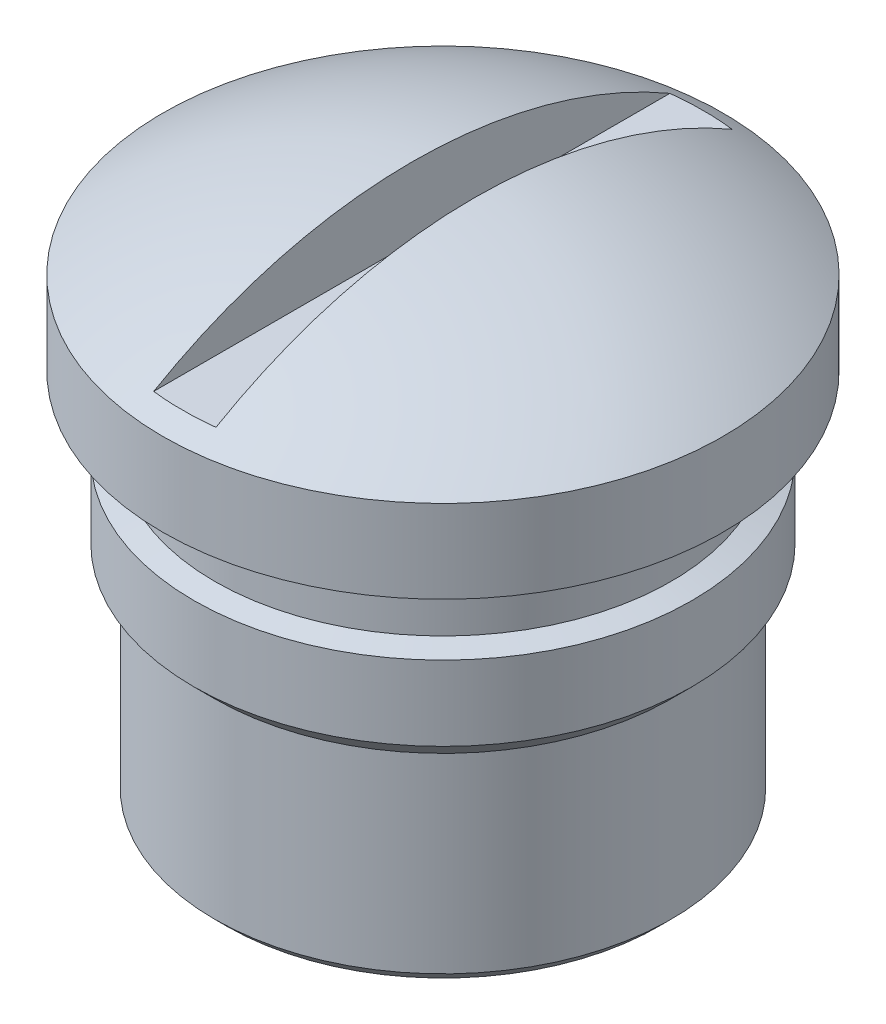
ISO-10303-21;
HEADER;
FILE_DESCRIPTION(('STEP AP214'),'2;1');
FILE_NAME('part.step','',(''),(''),'','','');
FILE_SCHEMA(('AUTOMOTIVE_DESIGN { 1 0 10303 214 1 1 1 1 }'));
ENDSEC;
DATA;
#1=APPLICATION_CONTEXT('core data for automotive mechanical design processes');
#2=APPLICATION_PROTOCOL_DEFINITION('international standard','automotive_design',2000,#1);
#3=PRODUCT_CONTEXT('',#1,'mechanical');
#4=PRODUCT('Part','Part','',(#3));
#5=PRODUCT_RELATED_PRODUCT_CATEGORY('part','',(#4));
#6=PRODUCT_DEFINITION_FORMATION('','',#4);
#7=PRODUCT_DEFINITION_CONTEXT('part definition',#1,'design');
#8=PRODUCT_DEFINITION('design','',#6,#7);
#9=PRODUCT_DEFINITION_SHAPE('','',#8);
#10=(LENGTH_UNIT() NAMED_UNIT(*) SI_UNIT(.MILLI.,.METRE.));
#11=(NAMED_UNIT(*) PLANE_ANGLE_UNIT() SI_UNIT($,.RADIAN.));
#12=(NAMED_UNIT(*) SI_UNIT($,.STERADIAN.) SOLID_ANGLE_UNIT());
#13=UNCERTAINTY_MEASURE_WITH_UNIT(LENGTH_MEASURE(1.E-05),#10,'distance_accuracy_value','');
#14=(GEOMETRIC_REPRESENTATION_CONTEXT(3) GLOBAL_UNCERTAINTY_ASSIGNED_CONTEXT((#13)) GLOBAL_UNIT_ASSIGNED_CONTEXT((#10,
#11,#12)) REPRESENTATION_CONTEXT('',''));
#15=CARTESIAN_POINT('',(0.,0.,0.));
#16=DIRECTION('',(0.,0.,1.));
#17=DIRECTION('',(1.,0.,0.));
#18=AXIS2_PLACEMENT_3D('',#15,#16,#17);
#19=CARTESIAN_POINT('',(0.75,2.3,-6.75));
#20=DIRECTION('',(0.,-1.,0.));
#21=DIRECTION('',(1.,0.,0.));
#22=AXIS2_PLACEMENT_3D('',#19,#20,#21);
#23=PLANE('',#22);
#24=DIRECTION('',(0.,0.,1.));
#25=VECTOR('',#24,1.);
#26=CARTESIAN_POINT('',(-0.75,2.3,-6.75));
#27=LINE('',#26,#25);
#28=CARTESIAN_POINT('',(-0.750000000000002,2.3,-6.21897298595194));
#29=VERTEX_POINT('',#28);
#30=CARTESIAN_POINT('',(-0.750000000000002,2.3,6.21897298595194));
#31=VERTEX_POINT('',#30);
#32=EDGE_CURVE('E60',#29,#31,#27,.T.);
#33=ORIENTED_EDGE('',*,*,#32,.T.);
#34=CARTESIAN_POINT('',(0.749999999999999,2.3,6.21897298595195));
#35=CARTESIAN_POINT('',(0.687604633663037,2.3,6.22649809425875));
#36=CARTESIAN_POINT('',(0.625095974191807,2.3,6.23308357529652));
#37=CARTESIAN_POINT('',(0.500077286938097,2.3,6.2443554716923));
#38=CARTESIAN_POINT('',(0.437567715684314,2.3,6.24904695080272));
#39=CARTESIAN_POINT('',(0.312548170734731,2.3,6.25654484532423));
#40=CARTESIAN_POINT('',(0.250038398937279,2.3,6.25935462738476));
#41=CARTESIAN_POINT('',(0.125019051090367,2.3,6.26309848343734));
#42=CARTESIAN_POINT('',(0.0625095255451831,2.3,6.26403424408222));
#43=CARTESIAN_POINT('',(-0.0625095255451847,2.3,6.26403424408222));
#44=CARTESIAN_POINT('',(-0.125019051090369,2.3,6.26309848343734));
#45=CARTESIAN_POINT('',(-0.250038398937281,2.3,6.25935462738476));
#46=CARTESIAN_POINT('',(-0.312548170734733,2.3,6.25654484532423));
#47=CARTESIAN_POINT('',(-0.437567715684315,2.3,6.24904695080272));
#48=CARTESIAN_POINT('',(-0.500077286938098,2.3,6.2443554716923));
#49=CARTESIAN_POINT('',(-0.625095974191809,2.3,6.23308357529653));
#50=CARTESIAN_POINT('',(-0.687604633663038,2.3,6.22649809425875));
#51=CARTESIAN_POINT('',(-0.750000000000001,2.3,6.21897298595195));
#52=B_SPLINE_CURVE_WITH_KNOTS('',3,(#34,#35,#36,#37,#38,#39,#40,#41,#42,#43,#44,#45,#46,#47,#48,
#49,#50,#51),.UNSPECIFIED.,.F.,.F.,(4,2,2,2,2,2,2,2,4),(0.,0.188535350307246,0.376563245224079,
0.564253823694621,0.751775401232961,0.939296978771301,1.12698755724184,1.31501545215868,
1.50355080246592),.UNSPECIFIED.);
#53=CARTESIAN_POINT('',(0.749999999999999,2.3,6.21897298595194));
#54=VERTEX_POINT('',#53);
#55=EDGE_CURVE('E21',#54,#31,#52,.T.);
#56=ORIENTED_EDGE('',*,*,#55,.F.);
#57=DIRECTION('',(0.,0.,1.));
#58=VECTOR('',#57,1.);
#59=CARTESIAN_POINT('',(0.75,2.3,-6.75));
#60=LINE('',#59,#58);
#61=CARTESIAN_POINT('',(0.749999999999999,2.3,-6.21897298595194));
#62=VERTEX_POINT('',#61);
#63=EDGE_CURVE('E61',#54,#62,#60,.F.);
#64=ORIENTED_EDGE('',*,*,#63,.T.);
#65=CARTESIAN_POINT('',(-0.750000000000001,2.3,-6.21897298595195));
#66=CARTESIAN_POINT('',(-0.687604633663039,2.3,-6.22649809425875));
#67=CARTESIAN_POINT('',(-0.625095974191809,2.3,-6.23308357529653));
#68=CARTESIAN_POINT('',(-0.500077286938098,2.3,-6.2443554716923));
#69=CARTESIAN_POINT('',(-0.437567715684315,2.3,-6.24904695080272));
#70=CARTESIAN_POINT('',(-0.312548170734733,2.3,-6.25654484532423));
#71=CARTESIAN_POINT('',(-0.250038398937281,2.3,-6.25935462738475));
#72=CARTESIAN_POINT('',(-0.125019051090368,2.3,-6.26309848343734));
#73=CARTESIAN_POINT('',(-0.0625095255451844,2.3,-6.26403424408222));
#74=CARTESIAN_POINT('',(0.0625095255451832,2.3,-6.26403424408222));
#75=CARTESIAN_POINT('',(0.125019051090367,2.3,-6.26309848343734));
#76=CARTESIAN_POINT('',(0.250038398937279,2.3,-6.25935462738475));
#77=CARTESIAN_POINT('',(0.312548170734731,2.3,-6.25654484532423));
#78=CARTESIAN_POINT('',(0.437567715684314,2.3,-6.24904695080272));
#79=CARTESIAN_POINT('',(0.500077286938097,2.3,-6.2443554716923));
#80=CARTESIAN_POINT('',(0.625095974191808,2.3,-6.23308357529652));
#81=CARTESIAN_POINT('',(0.687604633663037,2.3,-6.22649809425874));
#82=CARTESIAN_POINT('',(0.749999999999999,2.3,-6.21897298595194));
#83=B_SPLINE_CURVE_WITH_KNOTS('',3,(#65,#66,#67,#68,#69,#70,#71,#72,#73,#74,#75,#76,#77,#78,#79,
#80,#81,#82),.UNSPECIFIED.,.F.,.F.,(4,2,2,2,2,2,2,2,4),(0.,0.188535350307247,0.376563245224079,
0.564253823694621,0.751775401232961,0.939296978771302,1.12698755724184,1.31501545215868,
1.50355080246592),.UNSPECIFIED.);
#84=EDGE_CURVE('E54',#29,#62,#83,.T.);
#85=ORIENTED_EDGE('',*,*,#84,.F.);
#86=EDGE_LOOP('',(#33,#56,#64,#85));
#87=FACE_BOUND('',#86,.T.);
#88=ADVANCED_FACE('F17',(#87),#23,.F.);
#89=CARTESIAN_POINT('',(0.75,5.3,-6.75));
#90=DIRECTION('',(1.,0.,0.));
#91=DIRECTION('',(0.,1.,0.));
#92=AXIS2_PLACEMENT_3D('',#89,#90,#91);
#93=PLANE('',#92);
#94=CARTESIAN_POINT('',(0.749999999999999,-8.39062500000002,0.));
#95=DIRECTION('',(-1.,0.,0.));
#96=DIRECTION('',(0.,0.,1.));
#97=AXIS2_PLACEMENT_3D('',#94,#95,#96);
#98=CIRCLE('',#97,12.3679055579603);
#99=EDGE_CURVE('E58',#62,#54,#98,.F.);
#100=ORIENTED_EDGE('',*,*,#99,.F.);
#101=ORIENTED_EDGE('',*,*,#63,.F.);
#102=EDGE_LOOP('',(#100,#101));
#103=FACE_BOUND('',#102,.T.);
#104=ADVANCED_FACE('F96',(#103),#93,.F.);
#105=CARTESIAN_POINT('',(-0.75,5.3,-6.75));
#106=DIRECTION('',(-1.,0.,0.));
#107=DIRECTION('',(0.,-1.,0.));
#108=AXIS2_PLACEMENT_3D('',#105,#106,#107);
#109=PLANE('',#108);
#110=CARTESIAN_POINT('',(-0.750000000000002,-8.39062500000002,0.));
#111=DIRECTION('',(-1.,0.,0.));
#112=DIRECTION('',(0.,0.,1.));
#113=AXIS2_PLACEMENT_3D('',#110,#111,#112);
#114=CIRCLE('',#113,12.3679055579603);
#115=EDGE_CURVE('E50',#31,#29,#114,.T.);
#116=ORIENTED_EDGE('',*,*,#115,.F.);
#117=ORIENTED_EDGE('',*,*,#32,.F.);
#118=EDGE_LOOP('',(#116,#117));
#119=FACE_BOUND('',#118,.T.);
#120=ADVANCED_FACE('F62',(#119),#109,.F.);
#121=CARTESIAN_POINT('',(0.,-8.39062500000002,0.));
#122=DIRECTION('',(-1.,0.,0.));
#123=DIRECTION('',(0.,-1.,0.));
#124=AXIS2_PLACEMENT_3D('',#121,#122,#123);
#125=SPHERICAL_SURFACE('',#124,12.390625);
#126=ORIENTED_EDGE('',*,*,#84,.T.);
#127=ORIENTED_EDGE('',*,*,#99,.T.);
#128=ORIENTED_EDGE('',*,*,#55,.T.);
#129=ORIENTED_EDGE('',*,*,#115,.T.);
#130=EDGE_LOOP('',(#126,#127,#128,#129));
#131=FACE_BOUND('',#130,.T.);
#132=CARTESIAN_POINT('',(0.,2.,0.));
#133=DIRECTION('',(0.,1.,0.));
#134=DIRECTION('',(0.,0.,1.));
#135=AXIS2_PLACEMENT_3D('',#132,#133,#134);
#136=CIRCLE('',#135,6.75);
#137=CARTESIAN_POINT('',(0.,2.,6.75));
#138=VERTEX_POINT('',#137);
#139=EDGE_CURVE('E57',#138,#138,#136,.F.);
#140=ORIENTED_EDGE('',*,*,#139,.F.);
#141=EDGE_LOOP('',(#140));
#142=FACE_BOUND('',#141,.T.);
#143=ADVANCED_FACE('F52',(#131,#142),#125,.T.);
#144=CARTESIAN_POINT('',(0.,15.1400037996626,0.));
#145=DIRECTION('',(0.,1.,0.));
#146=DIRECTION('',(0.,0.,1.));
#147=AXIS2_PLACEMENT_3D('',#144,#145,#146);
#148=CYLINDRICAL_SURFACE('',#147,6.75);
#149=ORIENTED_EDGE('',*,*,#139,.T.);
#150=EDGE_LOOP('',(#149));
#151=FACE_BOUND('',#150,.T.);
#152=CARTESIAN_POINT('',(0.,0.,0.));
#153=DIRECTION('',(0.,1.,0.));
#154=DIRECTION('',(0.,0.,1.));
#155=AXIS2_PLACEMENT_3D('',#152,#153,#154);
#156=CIRCLE('',#155,6.75);
#157=CARTESIAN_POINT('',(0.,0.,6.75));
#158=VERTEX_POINT('',#157);
#159=EDGE_CURVE('E80',#158,#158,#156,.T.);
#160=ORIENTED_EDGE('',*,*,#159,.T.);
#161=EDGE_LOOP('',(#160));
#162=FACE_BOUND('',#161,.T.);
#163=ADVANCED_FACE('F92',(#151,#162),#148,.T.);
#164=CARTESIAN_POINT('',(5.5,0.,0.));
#165=DIRECTION('',(0.,1.,0.));
#166=DIRECTION('',(0.,0.,1.));
#167=AXIS2_PLACEMENT_3D('',#164,#165,#166);
#168=PLANE('',#167);
#169=CARTESIAN_POINT('',(0.,0.,0.));
#170=DIRECTION('',(0.,1.,0.));
#171=DIRECTION('',(0.,0.,1.));
#172=AXIS2_PLACEMENT_3D('',#169,#170,#171);
#173=CIRCLE('',#172,5.5);
#174=CARTESIAN_POINT('',(0.,0.,5.5));
#175=VERTEX_POINT('',#174);
#176=EDGE_CURVE('E76',#175,#175,#173,.F.);
#177=ORIENTED_EDGE('',*,*,#176,.F.);
#178=EDGE_LOOP('',(#177));
#179=FACE_BOUND('',#178,.T.);
#180=ORIENTED_EDGE('',*,*,#159,.F.);
#181=EDGE_LOOP('',(#180));
#182=FACE_BOUND('',#181,.T.);
#183=ADVANCED_FACE('F142',(#179,#182),#168,.F.);
#184=CARTESIAN_POINT('',(0.,15.1400037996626,0.));
#185=DIRECTION('',(0.,1.,0.));
#186=DIRECTION('',(0.,0.,1.));
#187=AXIS2_PLACEMENT_3D('',#184,#185,#186);
#188=CYLINDRICAL_SURFACE('',#187,5.5);
#189=CARTESIAN_POINT('',(0.,-1.65000000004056,0.));
#190=DIRECTION('',(0.,-1.,0.));
#191=DIRECTION('',(0.,0.,-1.));
#192=AXIS2_PLACEMENT_3D('',#189,#190,#191);
#193=CIRCLE('',#192,5.49999999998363);
#194=CARTESIAN_POINT('',(0.,-1.65000000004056,-5.49999999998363));
#195=VERTEX_POINT('',#194);
#196=EDGE_CURVE('E79',#195,#195,#193,.T.);
#197=ORIENTED_EDGE('',*,*,#196,.F.);
#198=EDGE_LOOP('',(#197));
#199=FACE_BOUND('',#198,.T.);
#200=ORIENTED_EDGE('',*,*,#176,.T.);
#201=EDGE_LOOP('',(#200));
#202=FACE_BOUND('',#201,.T.);
#203=ADVANCED_FACE('F139',(#199,#202),#188,.T.);
#204=CARTESIAN_POINT('',(0.,-1.80000000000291,0.));
#205=DIRECTION('',(0.,-1.,0.));
#206=DIRECTION('',(0.,0.,-1.));
#207=AXIS2_PLACEMENT_3D('',#204,#205,#206);
#208=CONICAL_SURFACE('',#207,5.99999999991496,1.2793395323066);
#209=ORIENTED_EDGE('',*,*,#196,.T.);
#210=EDGE_LOOP('',(#209));
#211=FACE_BOUND('',#210,.T.);
#212=CARTESIAN_POINT('',(0.,-1.8,0.));
#213=DIRECTION('',(0.,1.,0.));
#214=DIRECTION('',(0.,0.,1.));
#215=AXIS2_PLACEMENT_3D('',#212,#213,#214);
#216=CIRCLE('',#215,6.);
#217=CARTESIAN_POINT('',(0.,-1.8,6.));
#218=VERTEX_POINT('',#217);
#219=EDGE_CURVE('E252',#218,#218,#216,.F.);
#220=ORIENTED_EDGE('',*,*,#219,.F.);
#221=EDGE_LOOP('',(#220));
#222=FACE_BOUND('',#221,.T.);
#223=ADVANCED_FACE('F135',(#211,#222),#208,.T.);
#224=CARTESIAN_POINT('',(0.,-4.5,0.));
#225=DIRECTION('',(0.,1.,0.));
#226=DIRECTION('',(0.,0.,1.));
#227=AXIS2_PLACEMENT_3D('',#224,#225,#226);
#228=CYLINDRICAL_SURFACE('',#227,6.);
#229=CARTESIAN_POINT('',(0.,-3.60000000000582,0.));
#230=DIRECTION('',(0.,1.,0.));
#231=DIRECTION('',(0.,0.,1.));
#232=AXIS2_PLACEMENT_3D('',#229,#230,#231);
#233=CIRCLE('',#232,6.00000000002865);
#234=CARTESIAN_POINT('',(0.,-3.60000000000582,6.00000000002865));
#235=VERTEX_POINT('',#234);
#236=EDGE_CURVE('E254',#235,#235,#233,.F.);
#237=ORIENTED_EDGE('',*,*,#236,.F.);
#238=EDGE_LOOP('',(#237));
#239=FACE_BOUND('',#238,.T.);
#240=ORIENTED_EDGE('',*,*,#219,.T.);
#241=EDGE_LOOP('',(#240));
#242=FACE_BOUND('',#241,.T.);
#243=ADVANCED_FACE('F131',(#239,#242),#228,.T.);
#244=CARTESIAN_POINT('',(0.,-3.60000000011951,0.));
#245=DIRECTION('',(0.,1.,0.));
#246=DIRECTION('',(0.,0.,1.));
#247=AXIS2_PLACEMENT_3D('',#244,#245,#246);
#248=CONICAL_SURFACE('',#247,5.99999999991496,0.785398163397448);
#249=CARTESIAN_POINT('',(0.,-4.1,0.));
#250=DIRECTION('',(0.,1.,0.));
#251=DIRECTION('',(0.,0.,1.));
#252=AXIS2_PLACEMENT_3D('',#249,#250,#251);
#253=CIRCLE('',#252,5.5);
#254=CARTESIAN_POINT('',(0.,-4.1,5.5));
#255=VERTEX_POINT('',#254);
#256=EDGE_CURVE('E259',#255,#255,#253,.F.);
#257=ORIENTED_EDGE('',*,*,#256,.F.);
#258=EDGE_LOOP('',(#257));
#259=FACE_BOUND('',#258,.T.);
#260=ORIENTED_EDGE('',*,*,#236,.T.);
#261=EDGE_LOOP('',(#260));
#262=FACE_BOUND('',#261,.T.);
#263=ADVANCED_FACE('F127',(#259,#262),#248,.T.);
#264=CARTESIAN_POINT('',(0.,15.1400037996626,0.));
#265=DIRECTION('',(0.,1.,0.));
#266=DIRECTION('',(0.,0.,1.));
#267=AXIS2_PLACEMENT_3D('',#264,#265,#266);
#268=CYLINDRICAL_SURFACE('',#267,5.5);
#269=CARTESIAN_POINT('',(0.,-8.70000000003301,0.));
#270=DIRECTION('',(0.,1.,0.));
#271=DIRECTION('',(0.,0.,1.));
#272=AXIS2_PLACEMENT_3D('',#269,#270,#271);
#273=CIRCLE('',#272,5.49999999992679);
#274=CARTESIAN_POINT('',(0.,-8.70000000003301,5.49999999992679));
#275=VERTEX_POINT('',#274);
#276=EDGE_CURVE('E75',#275,#275,#273,.F.);
#277=ORIENTED_EDGE('',*,*,#276,.F.);
#278=EDGE_LOOP('',(#277));
#279=FACE_BOUND('',#278,.T.);
#280=ORIENTED_EDGE('',*,*,#256,.T.);
#281=EDGE_LOOP('',(#280));
#282=FACE_BOUND('',#281,.T.);
#283=ADVANCED_FACE('F123',(#279,#282),#268,.T.);
#284=CARTESIAN_POINT('',(0.,-8.70000000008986,0.));
#285=DIRECTION('',(0.,1.,0.));
#286=DIRECTION('',(0.,0.,1.));
#287=AXIS2_PLACEMENT_3D('',#284,#285,#286);
#288=CONICAL_SURFACE('',#287,5.49999999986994,0.785398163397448);
#289=CARTESIAN_POINT('',(0.,-8.99999999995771,0.));
#290=DIRECTION('',(0.,1.,0.));
#291=DIRECTION('',(0.,0.,1.));
#292=AXIS2_PLACEMENT_3D('',#289,#290,#291);
#293=CIRCLE('',#292,5.20000000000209);
#294=CARTESIAN_POINT('',(0.,-8.99999999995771,5.20000000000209));
#295=VERTEX_POINT('',#294);
#296=EDGE_CURVE('E72',#295,#295,#293,.T.);
#297=ORIENTED_EDGE('',*,*,#296,.T.);
#298=EDGE_LOOP('',(#297));
#299=FACE_BOUND('',#298,.T.);
#300=ORIENTED_EDGE('',*,*,#276,.T.);
#301=EDGE_LOOP('',(#300));
#302=FACE_BOUND('',#301,.T.);
#303=ADVANCED_FACE('F119',(#299,#302),#288,.T.);
#304=CARTESIAN_POINT('',(0.,-9.00000000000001,0.));
#305=DIRECTION('',(0.,1.,0.));
#306=DIRECTION('',(0.,0.,1.));
#307=AXIS2_PLACEMENT_3D('',#304,#305,#306);
#308=PLANE('',#307);
#309=ORIENTED_EDGE('',*,*,#296,.F.);
#310=EDGE_LOOP('',(#309));
#311=FACE_BOUND('',#310,.T.);
#312=CARTESIAN_POINT('',(0.,-9.00000000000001,0.));
#313=DIRECTION('',(0.,-1.,0.));
#314=DIRECTION('',(0.,0.,-1.));
#315=AXIS2_PLACEMENT_3D('',#312,#313,#314);
#316=CIRCLE('',#315,4.25);
#317=CARTESIAN_POINT('',(0.,-9.00000000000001,-4.25));
#318=VERTEX_POINT('',#317);
#319=EDGE_CURVE('E31',#318,#318,#316,.F.);
#320=ORIENTED_EDGE('',*,*,#319,.T.);
#321=EDGE_LOOP('',(#320));
#322=FACE_BOUND('',#321,.T.);
#323=ADVANCED_FACE('F111',(#311,#322),#308,.F.);
#324=CARTESIAN_POINT('',(0.,0.,0.));
#325=DIRECTION('',(0.,-1.,0.));
#326=DIRECTION('',(0.,0.,-1.));
#327=AXIS2_PLACEMENT_3D('',#324,#325,#326);
#328=PLANE('',#327);
#329=CARTESIAN_POINT('',(0.,0.,0.));
#330=DIRECTION('',(0.,-1.,0.));
#331=DIRECTION('',(0.,0.,-1.));
#332=AXIS2_PLACEMENT_3D('',#329,#330,#331);
#333=CIRCLE('',#332,4.25);
#334=CARTESIAN_POINT('',(0.,0.,-4.25));
#335=VERTEX_POINT('',#334);
#336=EDGE_CURVE('E10',#335,#335,#333,.T.);
#337=ORIENTED_EDGE('',*,*,#336,.T.);
#338=EDGE_LOOP('',(#337));
#339=FACE_BOUND('',#338,.T.);
#340=ADVANCED_FACE('F105',(#339),#328,.T.);
#341=CARTESIAN_POINT('',(0.,0.,0.));
#342=DIRECTION('',(0.,-1.,0.));
#343=DIRECTION('',(0.,0.,-1.));
#344=AXIS2_PLACEMENT_3D('',#341,#342,#343);
#345=CYLINDRICAL_SURFACE('',#344,4.25);
#346=ORIENTED_EDGE('',*,*,#319,.F.);
#347=EDGE_LOOP('',(#346));
#348=FACE_BOUND('',#347,.T.);
#349=ORIENTED_EDGE('',*,*,#336,.F.);
#350=EDGE_LOOP('',(#349));
#351=FACE_BOUND('',#350,.T.);
#352=ADVANCED_FACE('F103',(#348,#351),#345,.F.);
#353=CLOSED_SHELL('',(#88,#104,#120,#143,#163,#183,#203,#223,#243,#263,#283,#303,#323,#340,#352));
#354=MANIFOLD_SOLID_BREP('B1',#353);
#355=ADVANCED_BREP_SHAPE_REPRESENTATION('',(#18,#354),#14);
#356=SHAPE_DEFINITION_REPRESENTATION(#9,#355);
ENDSEC;
END-ISO-10303-21;
